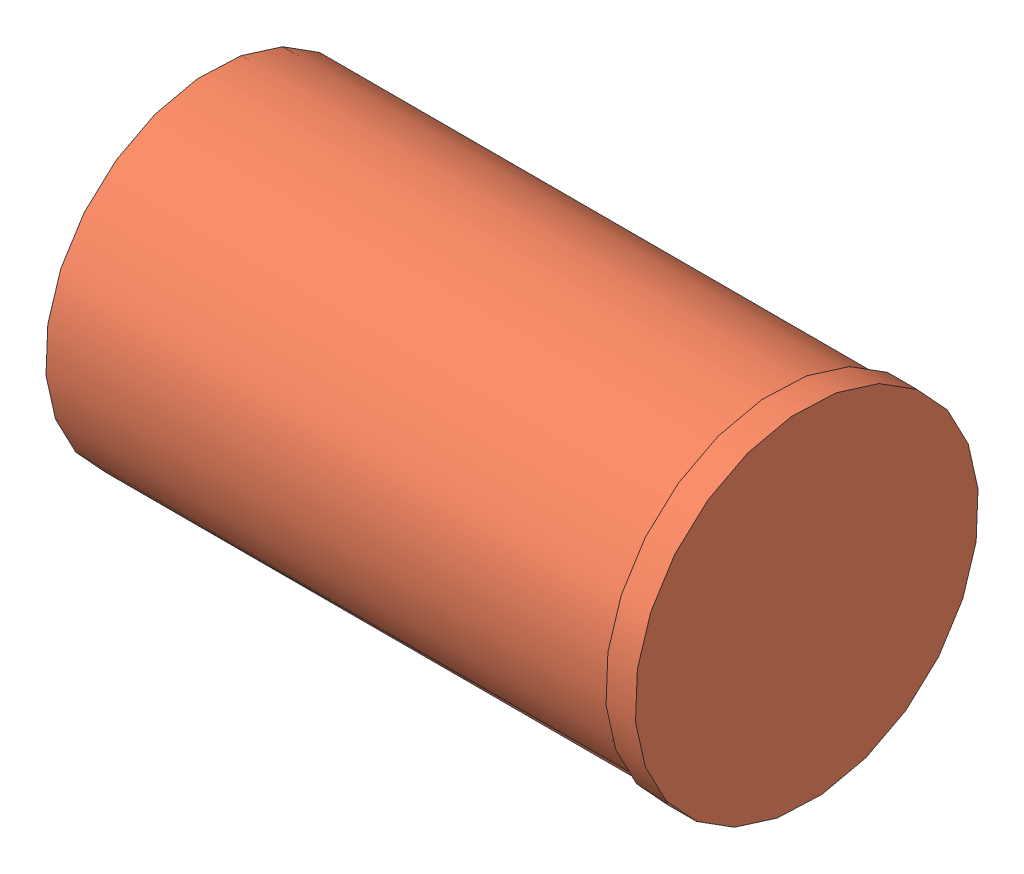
SolidWorks assembly moteur arriere stator.SLDASM, configuration Default (file format 4100). Lengths in mm.
Overall size (12.2 7.6 7.6).
2 component instances, 2 part files, 2 mates.
Components (placement in the parent):
- moteur arriere carter-1: moteur arriere carter.SLDPRT [Default] at origin size (11.6 6 6)
- moteur arriere bouchon plastique-1: moteur arriere bouchon plastique.SLDPRT [Default] at (12.2 0 0) x (-1 0 0) z (0 0.089351 -0.996) size (12.1 7 7)
Mates (geometry in assembly coordinates):
- Coaxiale1: concentric: cylinder of moteur arriere bouchon plastique-1 through (12.2 0 0) axis (1 0 0) radius 3.4; cylinder of moteur arriere carter-1 through (0 0 0) axis (-1 0 0) radius 2.9
- Coïncidente1: coincident anti-aligned: plane of moteur arriere carter-1 through (11.6 3 0) normal (1 0 0); plane of moteur arriere bouchon plastique-1 through (11.6 3.486 0.3127) normal (-1 0 0)
